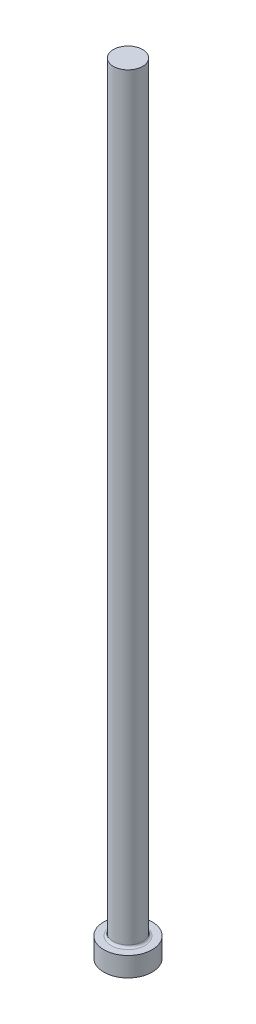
ISO-10303-21;
HEADER;
FILE_DESCRIPTION(('STEP AP214'),'2;1');
FILE_NAME('part.step','',(''),(''),'','','');
FILE_SCHEMA(('AUTOMOTIVE_DESIGN { 1 0 10303 214 1 1 1 1 }'));
ENDSEC;
DATA;
#1=APPLICATION_CONTEXT('core data for automotive mechanical design processes');
#2=APPLICATION_PROTOCOL_DEFINITION('international standard','automotive_design',2000,#1);
#3=PRODUCT_CONTEXT('',#1,'mechanical');
#4=PRODUCT('Part','Part','',(#3));
#5=PRODUCT_RELATED_PRODUCT_CATEGORY('part','',(#4));
#6=PRODUCT_DEFINITION_FORMATION('','',#4);
#7=PRODUCT_DEFINITION_CONTEXT('part definition',#1,'design');
#8=PRODUCT_DEFINITION('design','',#6,#7);
#9=PRODUCT_DEFINITION_SHAPE('','',#8);
#10=(LENGTH_UNIT() NAMED_UNIT(*) SI_UNIT(.MILLI.,.METRE.));
#11=(NAMED_UNIT(*) PLANE_ANGLE_UNIT() SI_UNIT($,.RADIAN.));
#12=(NAMED_UNIT(*) SI_UNIT($,.STERADIAN.) SOLID_ANGLE_UNIT());
#13=UNCERTAINTY_MEASURE_WITH_UNIT(LENGTH_MEASURE(1.E-05),#10,'distance_accuracy_value','');
#14=(GEOMETRIC_REPRESENTATION_CONTEXT(3) GLOBAL_UNCERTAINTY_ASSIGNED_CONTEXT((#13)) GLOBAL_UNIT_ASSIGNED_CONTEXT((#10,
#11,#12)) REPRESENTATION_CONTEXT('',''));
#15=CARTESIAN_POINT('',(0.,0.,0.));
#16=DIRECTION('',(0.,0.,1.));
#17=DIRECTION('',(1.,0.,0.));
#18=AXIS2_PLACEMENT_3D('',#15,#16,#17);
#19=CARTESIAN_POINT('',(4.7625,254.,0.));
#20=DIRECTION('',(0.,-1.,0.));
#21=DIRECTION('',(1.,0.,0.));
#22=AXIS2_PLACEMENT_3D('',#19,#20,#21);
#23=PLANE('',#22);
#24=CARTESIAN_POINT('',(0.,254.,0.));
#25=DIRECTION('',(0.,1.,0.));
#26=DIRECTION('',(-1.,0.,0.));
#27=AXIS2_PLACEMENT_3D('',#24,#25,#26);
#28=CIRCLE('',#27,4.76249999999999);
#29=CARTESIAN_POINT('',(-4.76249999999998,254.,0.));
#30=VERTEX_POINT('',#29);
#31=EDGE_CURVE('E10',#30,#30,#28,.T.);
#32=ORIENTED_EDGE('',*,*,#31,.T.);
#33=EDGE_LOOP('',(#32));
#34=FACE_BOUND('',#33,.T.);
#35=ADVANCED_FACE('F30',(#34),#23,.F.);
#36=CARTESIAN_POINT('',(0.,254.,0.));
#37=DIRECTION('',(0.,1.,0.));
#38=DIRECTION('',(-1.,0.,0.));
#39=AXIS2_PLACEMENT_3D('',#36,#37,#38);
#40=CYLINDRICAL_SURFACE('',#39,4.76249999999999);
#41=ORIENTED_EDGE('',*,*,#31,.F.);
#42=EDGE_LOOP('',(#41));
#43=FACE_BOUND('',#42,.T.);
#44=CARTESIAN_POINT('',(0.,7.11200000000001,0.));
#45=DIRECTION('',(0.,1.,0.));
#46=DIRECTION('',(-1.,0.,0.));
#47=AXIS2_PLACEMENT_3D('',#44,#45,#46);
#48=CIRCLE('',#47,4.7625);
#49=CARTESIAN_POINT('',(-4.7625,7.11200000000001,0.));
#50=VERTEX_POINT('',#49);
#51=EDGE_CURVE('E36',#50,#50,#48,.T.);
#52=ORIENTED_EDGE('',*,*,#51,.T.);
#53=EDGE_LOOP('',(#52));
#54=FACE_BOUND('',#53,.T.);
#55=ADVANCED_FACE('F65',(#43,#54),#40,.T.);
#56=CARTESIAN_POINT('',(0.,7.112,0.));
#57=DIRECTION('',(0.,1.,0.));
#58=DIRECTION('',(-1.,0.,0.));
#59=AXIS2_PLACEMENT_3D('',#56,#57,#58);
#60=TOROIDAL_SURFACE('',#59,5.5245,0.762);
#61=ORIENTED_EDGE('',*,*,#51,.F.);
#62=EDGE_LOOP('',(#61));
#63=FACE_BOUND('',#62,.T.);
#64=CARTESIAN_POINT('',(0.,6.34999999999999,0.));
#65=DIRECTION('',(0.,1.,0.));
#66=DIRECTION('',(-1.,0.,0.));
#67=AXIS2_PLACEMENT_3D('',#64,#65,#66);
#68=CIRCLE('',#67,5.5245);
#69=CARTESIAN_POINT('',(-5.5245,6.34999999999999,0.));
#70=VERTEX_POINT('',#69);
#71=EDGE_CURVE('E40',#70,#70,#68,.T.);
#72=ORIENTED_EDGE('',*,*,#71,.T.);
#73=EDGE_LOOP('',(#72));
#74=FACE_BOUND('',#73,.T.);
#75=ADVANCED_FACE('F69',(#63,#74),#60,.F.);
#76=CARTESIAN_POINT('',(7.874,6.35,0.));
#77=DIRECTION('',(0.,-1.,0.));
#78=DIRECTION('',(1.,0.,0.));
#79=AXIS2_PLACEMENT_3D('',#76,#77,#78);
#80=PLANE('',#79);
#81=ORIENTED_EDGE('',*,*,#71,.F.);
#82=EDGE_LOOP('',(#81));
#83=FACE_BOUND('',#82,.T.);
#84=CARTESIAN_POINT('',(0.,6.34999999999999,0.));
#85=DIRECTION('',(0.,1.,0.));
#86=DIRECTION('',(-1.,0.,0.));
#87=AXIS2_PLACEMENT_3D('',#84,#85,#86);
#88=CIRCLE('',#87,7.874);
#89=CARTESIAN_POINT('',(-7.874,6.34999999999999,0.));
#90=VERTEX_POINT('',#89);
#91=EDGE_CURVE('E44',#90,#90,#88,.T.);
#92=ORIENTED_EDGE('',*,*,#91,.T.);
#93=EDGE_LOOP('',(#92));
#94=FACE_BOUND('',#93,.T.);
#95=ADVANCED_FACE('F61',(#83,#94),#80,.F.);
#96=CARTESIAN_POINT('',(0.,254.,0.));
#97=DIRECTION('',(0.,1.,0.));
#98=DIRECTION('',(-1.,0.,0.));
#99=AXIS2_PLACEMENT_3D('',#96,#97,#98);
#100=CYLINDRICAL_SURFACE('',#99,7.874);
#101=ORIENTED_EDGE('',*,*,#91,.F.);
#102=EDGE_LOOP('',(#101));
#103=FACE_BOUND('',#102,.T.);
#104=CARTESIAN_POINT('',(0.,0.,0.));
#105=DIRECTION('',(0.,1.,0.));
#106=DIRECTION('',(-1.,0.,0.));
#107=AXIS2_PLACEMENT_3D('',#104,#105,#106);
#108=CIRCLE('',#107,7.874);
#109=CARTESIAN_POINT('',(-7.874,0.,0.));
#110=VERTEX_POINT('',#109);
#111=EDGE_CURVE('E49',#110,#110,#108,.T.);
#112=ORIENTED_EDGE('',*,*,#111,.T.);
#113=EDGE_LOOP('',(#112));
#114=FACE_BOUND('',#113,.T.);
#115=ADVANCED_FACE('F53',(#103,#114),#100,.T.);
#116=CARTESIAN_POINT('',(0.,0.,0.));
#117=DIRECTION('',(0.,1.,0.));
#118=DIRECTION('',(-1.,0.,0.));
#119=AXIS2_PLACEMENT_3D('',#116,#117,#118);
#120=PLANE('',#119);
#121=ORIENTED_EDGE('',*,*,#111,.F.);
#122=EDGE_LOOP('',(#121));
#123=FACE_BOUND('',#122,.T.);
#124=ADVANCED_FACE('F55',(#123),#120,.F.);
#125=CLOSED_SHELL('',(#35,#55,#75,#95,#115,#124));
#126=MANIFOLD_SOLID_BREP('B2',#125);
#127=ADVANCED_BREP_SHAPE_REPRESENTATION('',(#18,#126),#14);
#128=SHAPE_DEFINITION_REPRESENTATION(#9,#127);
ENDSEC;
END-ISO-10303-21;
